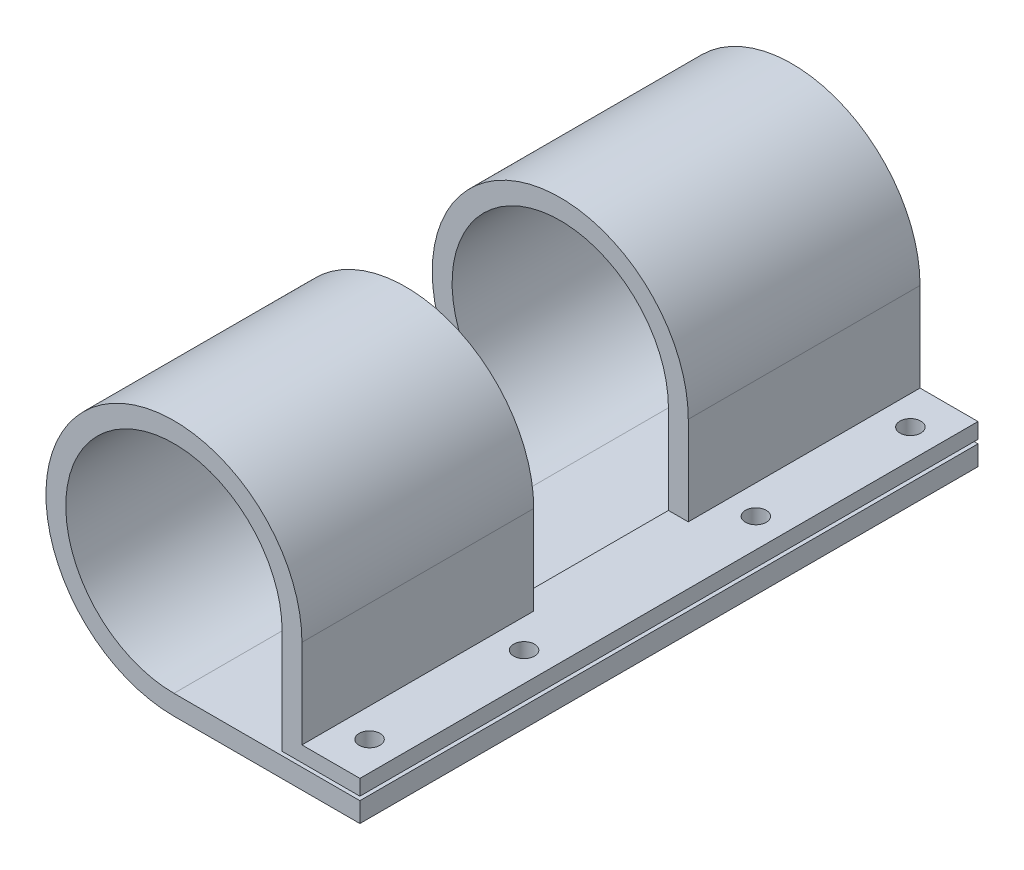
from build123d import *

# Parameters (mm, degrees)
BOSS_EXTRUDE1_DEPTH      = 50.8
BOSS_EXTRUDE1_DEPTH_BACK = 50.8
SKETCH2_W                = 25.4
SKETCH2_H                = 6.435
SKETCH2_H_2              = 29.21
CUT_EXTRUDE1_DEPTH       = 50.8
SKETCH3_R                = 1.7145
CUT_EXTRUDE2_DEPTH       = 50.8


with BuildPart() as part:
    # Sketch1 → Boss-Extrude1 (new, two sides: drawn at the far end of the back side and taken through both)
    with BuildSketch(Plane.XY.offset(-BOSS_EXTRUDE1_DEPTH_BACK)):
        with BuildLine():
            Line((0, -21.04), (30.565, -21.04))
            Line((30.565, -21.04), (30.565, -17.78))
            Line((30.565, -17.78), (18.5, -17.78))
            Line((18.5, -17.78), (0, -17.78))
            ThreePointArc((0, -17.78), (-12.572358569, 12.572358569), (17.78, 0))
            Line((17.78, 0), (17.78, -17.145))
            Line((17.78, -17.145), (30.565, -17.145))
            Line((30.565, -17.145), (30.565, -14.605))
            Line((30.565, -14.605), (21.04, -14.605))
            Line((21.04, -14.605), (21.04, 0))
            ThreePointArc((21.04, 0), (-14.877526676, 14.877526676), (0, -21.04))
        make_face()
    extrude(amount=BOSS_EXTRUDE1_DEPTH + BOSS_EXTRUDE1_DEPTH_BACK)

    # Sketch2 → Cut-Extrude1 (cut)
    with BuildSketch(Plane(origin=(21.04, 0, 0), x_dir=(0, 0, -1), z_dir=(1, 0, 0))):
        with Locations((0, 17.8225)):
            Rectangle(SKETCH2_W, SKETCH2_H)
        Rectangle(SKETCH2_W, SKETCH2_H_2)
    extrude(amount=-CUT_EXTRUDE1_DEPTH, mode=Mode.SUBTRACT)

    # Sketch3 → Cut-Extrude2 (cut)
    with BuildSketch(Plane(origin=(0, -14.605, 0), x_dir=(1, 0, 0), z_dir=(0, 1, 0))):
        with Locations(Location((25.8025, 44.45, 0), (0, 0, 270))):
            Circle(SKETCH3_R)
        with Locations(Location((25.8025, 19.05, 0), (0, 0, 270))):
            Circle(SKETCH3_R)
        with Locations(Location((25.8025, -44.45, 0), (0, 0, 270))):
            Circle(SKETCH3_R)
        with Locations(Location((25.8025, -19.05, 0), (0, 0, 270))):
            Circle(SKETCH3_R)
    extrude(amount=-CUT_EXTRUDE2_DEPTH, mode=Mode.SUBTRACT)


solid = part.part
